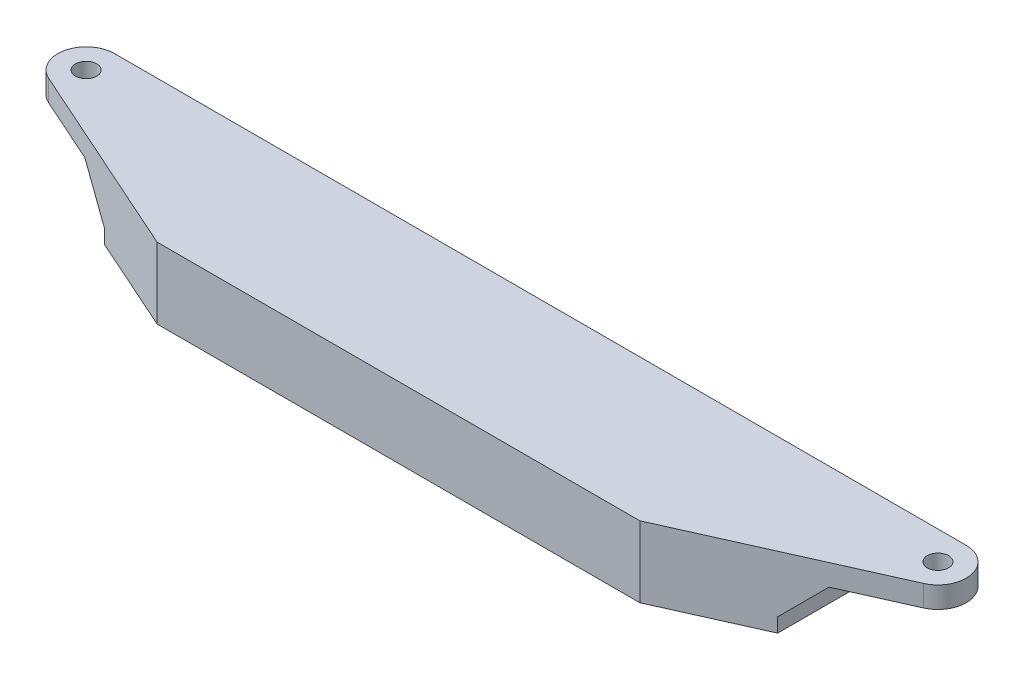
ISO-10303-21;
HEADER;
FILE_DESCRIPTION(('STEP AP214'),'2;1');
FILE_NAME('part.step','',(''),(''),'','','');
FILE_SCHEMA(('AUTOMOTIVE_DESIGN { 1 0 10303 214 1 1 1 1 }'));
ENDSEC;
DATA;
#1=APPLICATION_CONTEXT('core data for automotive mechanical design processes');
#2=APPLICATION_PROTOCOL_DEFINITION('international standard','automotive_design',2000,#1);
#3=PRODUCT_CONTEXT('',#1,'mechanical');
#4=PRODUCT('Part','Part','',(#3));
#5=PRODUCT_RELATED_PRODUCT_CATEGORY('part','',(#4));
#6=PRODUCT_DEFINITION_FORMATION('','',#4);
#7=PRODUCT_DEFINITION_CONTEXT('part definition',#1,'design');
#8=PRODUCT_DEFINITION('design','',#6,#7);
#9=PRODUCT_DEFINITION_SHAPE('','',#8);
#10=(LENGTH_UNIT() NAMED_UNIT(*) SI_UNIT(.MILLI.,.METRE.));
#11=(NAMED_UNIT(*) PLANE_ANGLE_UNIT() SI_UNIT($,.RADIAN.));
#12=(NAMED_UNIT(*) SI_UNIT($,.STERADIAN.) SOLID_ANGLE_UNIT());
#13=UNCERTAINTY_MEASURE_WITH_UNIT(LENGTH_MEASURE(1.E-05),#10,'distance_accuracy_value','');
#14=(GEOMETRIC_REPRESENTATION_CONTEXT(3) GLOBAL_UNCERTAINTY_ASSIGNED_CONTEXT((#13)) GLOBAL_UNIT_ASSIGNED_CONTEXT((#10,
#11,#12)) REPRESENTATION_CONTEXT('',''));
#15=CARTESIAN_POINT('',(0.,0.,0.));
#16=DIRECTION('',(0.,0.,1.));
#17=DIRECTION('',(1.,0.,0.));
#18=AXIS2_PLACEMENT_3D('',#15,#16,#17);
#19=CARTESIAN_POINT('',(60.,-8.,-4.00000000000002));
#20=DIRECTION('',(0.,1.,0.));
#21=DIRECTION('',(-1.,0.,0.));
#22=AXIS2_PLACEMENT_3D('',#19,#20,#21);
#23=PLANE('',#22);
#24=DIRECTION('',(0.912985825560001,0.,0.407991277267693));
#25=VECTOR('',#24,1.);
#26=CARTESIAN_POINT('',(-34.,-8.,16.));
#27=LINE('',#26,#25);
#28=CARTESIAN_POINT('',(-61.6319651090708,-8.,3.65194330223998));
#29=VERTEX_POINT('',#28);
#30=CARTESIAN_POINT('',(-34.,-8.,16.));
#31=VERTEX_POINT('',#30);
#32=EDGE_CURVE('E141',#29,#31,#27,.T.);
#33=ORIENTED_EDGE('',*,*,#32,.T.);
#34=DIRECTION('',(-1.,0.,0.));
#35=VECTOR('',#34,1.);
#36=CARTESIAN_POINT('',(-34.,-8.00000000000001,16.));
#37=LINE('',#36,#35);
#38=CARTESIAN_POINT('',(34.,-8.,16.));
#39=VERTEX_POINT('',#38);
#40=EDGE_CURVE('E138',#39,#31,#37,.T.);
#41=ORIENTED_EDGE('',*,*,#40,.F.);
#42=DIRECTION('',(-0.912985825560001,0.,0.407991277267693));
#43=VECTOR('',#42,1.);
#44=CARTESIAN_POINT('',(34.,-8.,16.));
#45=LINE('',#44,#43);
#46=CARTESIAN_POINT('',(61.6319651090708,-8.,3.65194330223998));
#47=VERTEX_POINT('',#46);
#48=EDGE_CURVE('E122',#47,#39,#45,.T.);
#49=ORIENTED_EDGE('',*,*,#48,.F.);
#50=CARTESIAN_POINT('',(60.,-8.,0.));
#51=DIRECTION('',(0.,1.,0.));
#52=DIRECTION('',(-1.,0.,0.));
#53=AXIS2_PLACEMENT_3D('',#50,#51,#52);
#54=CIRCLE('',#53,4.);
#55=CARTESIAN_POINT('',(60.,-8.,-4.00000000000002));
#56=VERTEX_POINT('',#55);
#57=EDGE_CURVE('E134',#56,#47,#54,.F.);
#58=ORIENTED_EDGE('',*,*,#57,.F.);
#59=DIRECTION('',(-1.,0.,0.));
#60=VECTOR('',#59,1.);
#61=CARTESIAN_POINT('',(-64.,-8.,-4.00000000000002));
#62=LINE('',#61,#60);
#63=CARTESIAN_POINT('',(-60.,-8.,-4.00000000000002));
#64=VERTEX_POINT('',#63);
#65=EDGE_CURVE('E175',#56,#64,#62,.T.);
#66=ORIENTED_EDGE('',*,*,#65,.T.);
#67=CARTESIAN_POINT('',(-60.,-8.,0.));
#68=DIRECTION('',(0.,-1.,0.));
#69=DIRECTION('',(1.,0.,0.));
#70=AXIS2_PLACEMENT_3D('',#67,#68,#69);
#71=CIRCLE('',#70,4.);
#72=EDGE_CURVE('E177',#64,#29,#71,.F.);
#73=ORIENTED_EDGE('',*,*,#72,.T.);
#74=EDGE_LOOP('',(#33,#41,#49,#58,#66,#73));
#75=FACE_BOUND('',#74,.T.);
#76=CARTESIAN_POINT('',(60.,-8.,0.));
#77=DIRECTION('',(0.,1.,0.));
#78=DIRECTION('',(-1.,0.,0.));
#79=AXIS2_PLACEMENT_3D('',#76,#77,#78);
#80=CIRCLE('',#79,1.5);
#81=CARTESIAN_POINT('',(58.5,-8.,0.));
#82=VERTEX_POINT('',#81);
#83=EDGE_CURVE('E180',#82,#82,#80,.T.);
#84=ORIENTED_EDGE('',*,*,#83,.F.);
#85=EDGE_LOOP('',(#84));
#86=FACE_BOUND('',#85,.T.);
#87=CARTESIAN_POINT('',(-60.,-8.,0.));
#88=DIRECTION('',(0.,-1.,0.));
#89=DIRECTION('',(1.,0.,0.));
#90=AXIS2_PLACEMENT_3D('',#87,#88,#89);
#91=CIRCLE('',#90,1.5);
#92=CARTESIAN_POINT('',(-58.5,-8.,0.));
#93=VERTEX_POINT('',#92);
#94=EDGE_CURVE('E39',#93,#93,#91,.F.);
#95=ORIENTED_EDGE('',*,*,#94,.F.);
#96=EDGE_LOOP('',(#95));
#97=FACE_BOUND('',#96,.T.);
#98=ADVANCED_FACE('F30',(#75,#86,#97),#23,.T.);
#99=CARTESIAN_POINT('',(-34.,11.,16.));
#100=DIRECTION('',(-0.407991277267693,0.,0.912985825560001));
#101=DIRECTION('',(0.912985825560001,0.,0.407991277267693));
#102=AXIS2_PLACEMENT_3D('',#99,#100,#101);
#103=PLANE('',#102);
#104=DIRECTION('',(0.,-1.,0.));
#105=VECTOR('',#104,1.);
#106=CARTESIAN_POINT('',(-34.,11.,16.));
#107=LINE('',#106,#105);
#108=CARTESIAN_POINT('',(-34.,-18.,16.));
#109=VERTEX_POINT('',#108);
#110=EDGE_CURVE('E150',#31,#109,#107,.T.);
#111=ORIENTED_EDGE('',*,*,#110,.F.);
#112=ORIENTED_EDGE('',*,*,#32,.F.);
#113=DIRECTION('',(0.,-1.,0.));
#114=VECTOR('',#113,1.);
#115=CARTESIAN_POINT('',(-61.6319651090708,11.,3.65194330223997));
#116=LINE('',#115,#114);
#117=CARTESIAN_POINT('',(-61.6319651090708,-11.,3.65194330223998));
#118=VERTEX_POINT('',#117);
#119=EDGE_CURVE('E153',#29,#118,#116,.T.);
#120=ORIENTED_EDGE('',*,*,#119,.T.);
#121=DIRECTION('',(0.912985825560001,0.,0.407991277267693));
#122=VECTOR('',#121,1.);
#123=CARTESIAN_POINT('',(-34.,-11.,16.));
#124=LINE('',#123,#122);
#125=CARTESIAN_POINT('',(-52.4265491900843,-11.,7.76562096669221));
#126=VERTEX_POINT('',#125);
#127=EDGE_CURVE('E214',#118,#126,#124,.T.);
#128=ORIENTED_EDGE('',*,*,#127,.T.);
#129=DIRECTION('',(-0.674246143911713,0.67424614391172,-0.301304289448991));
#130=VECTOR('',#129,1.);
#131=CARTESIAN_POINT('',(-54.816773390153,-8.6097757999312,6.6974875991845));
#132=LINE('',#131,#130);
#133=CARTESIAN_POINT('',(-47.4265491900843,-16.0000000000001,10.));
#134=VERTEX_POINT('',#133);
#135=EDGE_CURVE('E222',#126,#134,#132,.F.);
#136=ORIENTED_EDGE('',*,*,#135,.T.);
#137=DIRECTION('',(0.,-1.,0.));
#138=VECTOR('',#137,1.);
#139=CARTESIAN_POINT('',(-47.4265491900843,11.,10.));
#140=LINE('',#139,#138);
#141=CARTESIAN_POINT('',(-47.4265491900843,-18.,10.));
#142=VERTEX_POINT('',#141);
#143=EDGE_CURVE('E55',#134,#142,#140,.T.);
#144=ORIENTED_EDGE('',*,*,#143,.T.);
#145=DIRECTION('',(-0.912985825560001,0.,-0.407991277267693));
#146=VECTOR('',#145,1.);
#147=CARTESIAN_POINT('',(-34.,-18.,16.));
#148=LINE('',#147,#146);
#149=EDGE_CURVE('E151',#109,#142,#148,.T.);
#150=ORIENTED_EDGE('',*,*,#149,.F.);
#151=EDGE_LOOP('',(#111,#112,#120,#128,#136,#144,#150));
#152=FACE_BOUND('',#151,.T.);
#153=ADVANCED_FACE('F236',(#152),#103,.T.);
#154=CARTESIAN_POINT('',(-60.,11.,0.));
#155=DIRECTION('',(0.,-1.,0.));
#156=DIRECTION('',(0.,0.,-1.));
#157=AXIS2_PLACEMENT_3D('',#154,#155,#156);
#158=CYLINDRICAL_SURFACE('',#157,4.);
#159=DIRECTION('',(0.,-1.,0.));
#160=VECTOR('',#159,1.);
#161=CARTESIAN_POINT('',(-60.,11.,-4.00000000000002));
#162=LINE('',#161,#160);
#163=CARTESIAN_POINT('',(-60.,-11.,-4.00000000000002));
#164=VERTEX_POINT('',#163);
#165=EDGE_CURVE('E155',#64,#164,#162,.T.);
#166=ORIENTED_EDGE('',*,*,#165,.T.);
#167=CARTESIAN_POINT('',(-60.,-11.,0.));
#168=DIRECTION('',(0.,-1.,0.));
#169=DIRECTION('',(1.,0.,0.));
#170=AXIS2_PLACEMENT_3D('',#167,#168,#169);
#171=CIRCLE('',#170,4.);
#172=EDGE_CURVE('E47',#164,#118,#171,.F.);
#173=ORIENTED_EDGE('',*,*,#172,.T.);
#174=ORIENTED_EDGE('',*,*,#119,.F.);
#175=ORIENTED_EDGE('',*,*,#72,.F.);
#176=EDGE_LOOP('',(#166,#173,#174,#175));
#177=FACE_BOUND('',#176,.T.);
#178=ADVANCED_FACE('F245',(#177),#158,.T.);
#179=CARTESIAN_POINT('',(-64.,-11.,-4.00000000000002));
#180=DIRECTION('',(0.,-1.,0.));
#181=DIRECTION('',(1.,0.,0.));
#182=AXIS2_PLACEMENT_3D('',#179,#180,#181);
#183=PLANE('',#182);
#184=DIRECTION('',(1.,0.,0.));
#185=VECTOR('',#184,1.);
#186=CARTESIAN_POINT('',(-64.,-11.,-4.00000000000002));
#187=LINE('',#186,#185);
#188=CARTESIAN_POINT('',(-52.4265491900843,-11.,-4.00000000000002));
#189=VERTEX_POINT('',#188);
#190=EDGE_CURVE('E169',#164,#189,#187,.T.);
#191=ORIENTED_EDGE('',*,*,#190,.T.);
#192=DIRECTION('',(0.,0.,1.));
#193=VECTOR('',#192,1.);
#194=CARTESIAN_POINT('',(-52.4265491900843,-11.,10.));
#195=LINE('',#194,#193);
#196=EDGE_CURVE('E216',#189,#126,#195,.T.);
#197=ORIENTED_EDGE('',*,*,#196,.T.);
#198=ORIENTED_EDGE('',*,*,#127,.F.);
#199=ORIENTED_EDGE('',*,*,#172,.F.);
#200=EDGE_LOOP('',(#191,#197,#198,#199));
#201=FACE_BOUND('',#200,.T.);
#202=CARTESIAN_POINT('',(-60.,-11.,0.));
#203=DIRECTION('',(0.,-1.,0.));
#204=DIRECTION('',(1.,0.,0.));
#205=AXIS2_PLACEMENT_3D('',#202,#203,#204);
#206=CIRCLE('',#205,1.5);
#207=CARTESIAN_POINT('',(-58.5,-11.,0.));
#208=VERTEX_POINT('',#207);
#209=EDGE_CURVE('E11',#208,#208,#206,.F.);
#210=ORIENTED_EDGE('',*,*,#209,.T.);
#211=EDGE_LOOP('',(#210));
#212=FACE_BOUND('',#211,.T.);
#213=ADVANCED_FACE('F233',(#201,#212),#183,.T.);
#214=CARTESIAN_POINT('',(-60.,-18.,0.));
#215=DIRECTION('',(0.,1.,0.));
#216=DIRECTION('',(0.,0.,1.));
#217=AXIS2_PLACEMENT_3D('',#214,#215,#216);
#218=CYLINDRICAL_SURFACE('',#217,1.5);
#219=ORIENTED_EDGE('',*,*,#209,.F.);
#220=EDGE_LOOP('',(#219));
#221=FACE_BOUND('',#220,.T.);
#222=ORIENTED_EDGE('',*,*,#94,.T.);
#223=EDGE_LOOP('',(#222));
#224=FACE_BOUND('',#223,.T.);
#225=ADVANCED_FACE('F348',(#221,#224),#218,.F.);
#226=CARTESIAN_POINT('',(-52.4265491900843,-11.,-4.00000000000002));
#227=DIRECTION('',(-0.707106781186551,-0.707106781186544,0.));
#228=DIRECTION('',(0.707106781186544,-0.707106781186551,0.));
#229=AXIS2_PLACEMENT_3D('',#226,#227,#228);
#230=PLANE('',#229);
#231=DIRECTION('',(0.707106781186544,-0.707106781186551,0.));
#232=VECTOR('',#231,1.);
#233=CARTESIAN_POINT('',(-52.4265491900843,-11.,-4.00000000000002));
#234=LINE('',#233,#232);
#235=CARTESIAN_POINT('',(-47.4265491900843,-16.0000000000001,-4.00000000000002));
#236=VERTEX_POINT('',#235);
#237=EDGE_CURVE('E144',#236,#189,#234,.F.);
#238=ORIENTED_EDGE('',*,*,#237,.F.);
#239=DIRECTION('',(0.,0.,-1.));
#240=VECTOR('',#239,1.);
#241=CARTESIAN_POINT('',(-47.4265491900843,-16.0000000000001,-4.00000000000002));
#242=LINE('',#241,#240);
#243=EDGE_CURVE('E220',#134,#236,#242,.T.);
#244=ORIENTED_EDGE('',*,*,#243,.F.);
#245=ORIENTED_EDGE('',*,*,#135,.F.);
#246=ORIENTED_EDGE('',*,*,#196,.F.);
#247=EDGE_LOOP('',(#238,#244,#245,#246));
#248=FACE_BOUND('',#247,.T.);
#249=ADVANCED_FACE('F235',(#248),#230,.T.);
#250=CARTESIAN_POINT('',(-47.4265491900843,-18.,-4.00000000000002));
#251=DIRECTION('',(-1.,0.,0.));
#252=DIRECTION('',(0.,0.,1.));
#253=AXIS2_PLACEMENT_3D('',#250,#251,#252);
#254=PLANE('',#253);
#255=ORIENTED_EDGE('',*,*,#143,.F.);
#256=ORIENTED_EDGE('',*,*,#243,.T.);
#257=DIRECTION('',(0.,-1.,0.));
#258=VECTOR('',#257,1.);
#259=CARTESIAN_POINT('',(-47.4265491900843,-18.,-4.00000000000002));
#260=LINE('',#259,#258);
#261=CARTESIAN_POINT('',(-47.4265491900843,-18.,-4.00000000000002));
#262=VERTEX_POINT('',#261);
#263=EDGE_CURVE('E167',#236,#262,#260,.T.);
#264=ORIENTED_EDGE('',*,*,#263,.T.);
#265=DIRECTION('',(0.,0.,1.));
#266=VECTOR('',#265,1.);
#267=CARTESIAN_POINT('',(-47.4265491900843,-18.,-4.00000000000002));
#268=LINE('',#267,#266);
#269=EDGE_CURVE('E171',#262,#142,#268,.T.);
#270=ORIENTED_EDGE('',*,*,#269,.T.);
#271=EDGE_LOOP('',(#255,#256,#264,#270));
#272=FACE_BOUND('',#271,.T.);
#273=ADVANCED_FACE('F238',(#272),#254,.T.);
#274=CARTESIAN_POINT('',(60.,11.,0.));
#275=DIRECTION('',(0.,-1.,0.));
#276=DIRECTION('',(0.,0.,-1.));
#277=AXIS2_PLACEMENT_3D('',#274,#275,#276);
#278=CYLINDRICAL_SURFACE('',#277,4.);
#279=CARTESIAN_POINT('',(60.,-11.,0.));
#280=DIRECTION('',(0.,1.,0.));
#281=DIRECTION('',(-1.,0.,0.));
#282=AXIS2_PLACEMENT_3D('',#279,#280,#281);
#283=CIRCLE('',#282,4.);
#284=CARTESIAN_POINT('',(60.,-11.,-4.00000000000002));
#285=VERTEX_POINT('',#284);
#286=CARTESIAN_POINT('',(61.6319651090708,-11.,3.65194330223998));
#287=VERTEX_POINT('',#286);
#288=EDGE_CURVE('E188',#285,#287,#283,.F.);
#289=ORIENTED_EDGE('',*,*,#288,.F.);
#290=DIRECTION('',(0.,-1.,0.));
#291=VECTOR('',#290,1.);
#292=CARTESIAN_POINT('',(60.,11.,-4.00000000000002));
#293=LINE('',#292,#291);
#294=EDGE_CURVE('E160',#56,#285,#293,.T.);
#295=ORIENTED_EDGE('',*,*,#294,.F.);
#296=ORIENTED_EDGE('',*,*,#57,.T.);
#297=DIRECTION('',(0.,-1.,0.));
#298=VECTOR('',#297,1.);
#299=CARTESIAN_POINT('',(61.6319651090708,11.,3.65194330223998));
#300=LINE('',#299,#298);
#301=EDGE_CURVE('E130',#47,#287,#300,.T.);
#302=ORIENTED_EDGE('',*,*,#301,.T.);
#303=EDGE_LOOP('',(#289,#295,#296,#302));
#304=FACE_BOUND('',#303,.T.);
#305=ADVANCED_FACE('F250',(#304),#278,.T.);
#306=CARTESIAN_POINT('',(64.,-11.,-8.));
#307=DIRECTION('',(0.,1.,0.));
#308=DIRECTION('',(-1.,0.,0.));
#309=AXIS2_PLACEMENT_3D('',#306,#307,#308);
#310=PLANE('',#309);
#311=CARTESIAN_POINT('',(60.,-11.,0.));
#312=DIRECTION('',(0.,1.,0.));
#313=DIRECTION('',(-1.,0.,0.));
#314=AXIS2_PLACEMENT_3D('',#311,#312,#313);
#315=CIRCLE('',#314,1.5);
#316=CARTESIAN_POINT('',(58.5,-11.,0.));
#317=VERTEX_POINT('',#316);
#318=EDGE_CURVE('E179',#317,#317,#315,.T.);
#319=ORIENTED_EDGE('',*,*,#318,.T.);
#320=EDGE_LOOP('',(#319));
#321=FACE_BOUND('',#320,.T.);
#322=DIRECTION('',(-0.912985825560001,0.,0.407991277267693));
#323=VECTOR('',#322,1.);
#324=CARTESIAN_POINT('',(34.,-11.,16.));
#325=LINE('',#324,#323);
#326=CARTESIAN_POINT('',(52.4265491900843,-11.,7.76562096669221));
#327=VERTEX_POINT('',#326);
#328=EDGE_CURVE('E190',#287,#327,#325,.T.);
#329=ORIENTED_EDGE('',*,*,#328,.T.);
#330=DIRECTION('',(0.,0.,-1.));
#331=VECTOR('',#330,1.);
#332=CARTESIAN_POINT('',(52.4265491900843,-11.,-4.00000000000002));
#333=LINE('',#332,#331);
#334=CARTESIAN_POINT('',(52.4265491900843,-11.,-4.00000000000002));
#335=VERTEX_POINT('',#334);
#336=EDGE_CURVE('E207',#327,#335,#333,.T.);
#337=ORIENTED_EDGE('',*,*,#336,.T.);
#338=DIRECTION('',(1.,0.,0.));
#339=VECTOR('',#338,1.);
#340=CARTESIAN_POINT('',(-60.,-11.,-4.00000000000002));
#341=LINE('',#340,#339);
#342=EDGE_CURVE('E200',#335,#285,#341,.T.);
#343=ORIENTED_EDGE('',*,*,#342,.T.);
#344=ORIENTED_EDGE('',*,*,#288,.T.);
#345=EDGE_LOOP('',(#329,#337,#343,#344));
#346=FACE_BOUND('',#345,.T.);
#347=ADVANCED_FACE('F252',(#321,#346),#310,.F.);
#348=CARTESIAN_POINT('',(60.,-18.,0.));
#349=DIRECTION('',(0.,1.,0.));
#350=DIRECTION('',(0.,0.,1.));
#351=AXIS2_PLACEMENT_3D('',#348,#349,#350);
#352=CYLINDRICAL_SURFACE('',#351,1.5);
#353=ORIENTED_EDGE('',*,*,#83,.T.);
#354=EDGE_LOOP('',(#353));
#355=FACE_BOUND('',#354,.T.);
#356=ORIENTED_EDGE('',*,*,#318,.F.);
#357=EDGE_LOOP('',(#356));
#358=FACE_BOUND('',#357,.T.);
#359=ADVANCED_FACE('F270',(#355,#358),#352,.F.);
#360=CARTESIAN_POINT('',(47.4265491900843,-16.0000000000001,-8.));
#361=DIRECTION('',(0.707106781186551,-0.707106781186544,0.));
#362=DIRECTION('',(0.707106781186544,0.707106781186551,0.));
#363=AXIS2_PLACEMENT_3D('',#360,#361,#362);
#364=PLANE('',#363);
#365=DIRECTION('',(0.707106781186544,0.707106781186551,0.));
#366=VECTOR('',#365,1.);
#367=CARTESIAN_POINT('',(47.4265491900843,-16.0000000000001,-4.00000000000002));
#368=LINE('',#367,#366);
#369=CARTESIAN_POINT('',(47.4265491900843,-16.0000000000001,-4.00000000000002));
#370=VERTEX_POINT('',#369);
#371=EDGE_CURVE('E211',#335,#370,#368,.F.);
#372=ORIENTED_EDGE('',*,*,#371,.F.);
#373=ORIENTED_EDGE('',*,*,#336,.F.);
#374=DIRECTION('',(-0.674246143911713,-0.67424614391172,0.301304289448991));
#375=VECTOR('',#374,1.);
#376=CARTESIAN_POINT('',(51.083307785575,-12.3432414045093,8.36588305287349));
#377=LINE('',#376,#375);
#378=CARTESIAN_POINT('',(47.4265491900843,-16.0000000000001,10.));
#379=VERTEX_POINT('',#378);
#380=EDGE_CURVE('E209',#379,#327,#377,.F.);
#381=ORIENTED_EDGE('',*,*,#380,.F.);
#382=DIRECTION('',(0.,0.,1.));
#383=VECTOR('',#382,1.);
#384=CARTESIAN_POINT('',(47.4265491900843,-16.0000000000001,10.));
#385=LINE('',#384,#383);
#386=EDGE_CURVE('E202',#370,#379,#385,.T.);
#387=ORIENTED_EDGE('',*,*,#386,.F.);
#388=EDGE_LOOP('',(#372,#373,#381,#387));
#389=FACE_BOUND('',#388,.T.);
#390=ADVANCED_FACE('F258',(#389),#364,.T.);
#391=CARTESIAN_POINT('',(47.4265491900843,-18.,-8.));
#392=DIRECTION('',(-1.,0.,0.));
#393=DIRECTION('',(0.,0.,1.));
#394=AXIS2_PLACEMENT_3D('',#391,#392,#393);
#395=PLANE('',#394);
#396=DIRECTION('',(0.,1.,0.));
#397=VECTOR('',#396,1.);
#398=CARTESIAN_POINT('',(47.4265491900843,11.,-4.00000000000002));
#399=LINE('',#398,#397);
#400=CARTESIAN_POINT('',(47.4265491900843,-18.,-4.00000000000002));
#401=VERTEX_POINT('',#400);
#402=EDGE_CURVE('E183',#401,#370,#399,.T.);
#403=ORIENTED_EDGE('',*,*,#402,.T.);
#404=ORIENTED_EDGE('',*,*,#386,.T.);
#405=DIRECTION('',(0.,-1.,0.));
#406=VECTOR('',#405,1.);
#407=CARTESIAN_POINT('',(47.4265491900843,11.,10.));
#408=LINE('',#407,#406);
#409=CARTESIAN_POINT('',(47.4265491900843,-18.,10.));
#410=VERTEX_POINT('',#409);
#411=EDGE_CURVE('E186',#379,#410,#408,.T.);
#412=ORIENTED_EDGE('',*,*,#411,.T.);
#413=DIRECTION('',(0.,0.,1.));
#414=VECTOR('',#413,1.);
#415=CARTESIAN_POINT('',(47.4265491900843,-18.,0.));
#416=LINE('',#415,#414);
#417=EDGE_CURVE('E163',#401,#410,#416,.T.);
#418=ORIENTED_EDGE('',*,*,#417,.F.);
#419=EDGE_LOOP('',(#403,#404,#412,#418));
#420=FACE_BOUND('',#419,.T.);
#421=ADVANCED_FACE('F260',(#420),#395,.F.);
#422=CARTESIAN_POINT('',(60.,-18.,0.));
#423=DIRECTION('',(0.,1.,0.));
#424=DIRECTION('',(0.,0.,1.));
#425=AXIS2_PLACEMENT_3D('',#422,#423,#424);
#426=PLANE('',#425);
#427=ORIENTED_EDGE('',*,*,#269,.F.);
#428=DIRECTION('',(1.,0.,0.));
#429=VECTOR('',#428,1.);
#430=CARTESIAN_POINT('',(-60.,-18.,-4.00000000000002));
#431=LINE('',#430,#429);
#432=EDGE_CURVE('E149',#262,#401,#431,.T.);
#433=ORIENTED_EDGE('',*,*,#432,.T.);
#434=ORIENTED_EDGE('',*,*,#417,.T.);
#435=DIRECTION('',(-0.912985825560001,0.,0.407991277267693));
#436=VECTOR('',#435,1.);
#437=CARTESIAN_POINT('',(34.,-18.,16.));
#438=LINE('',#437,#436);
#439=CARTESIAN_POINT('',(34.,-18.,16.));
#440=VERTEX_POINT('',#439);
#441=EDGE_CURVE('E135',#410,#440,#438,.T.);
#442=ORIENTED_EDGE('',*,*,#441,.T.);
#443=DIRECTION('',(-1.,0.,0.));
#444=VECTOR('',#443,1.);
#445=CARTESIAN_POINT('',(-34.,-18.,16.));
#446=LINE('',#445,#444);
#447=EDGE_CURVE('E148',#440,#109,#446,.T.);
#448=ORIENTED_EDGE('',*,*,#447,.T.);
#449=ORIENTED_EDGE('',*,*,#149,.T.);
#450=EDGE_LOOP('',(#427,#433,#434,#442,#448,#449));
#451=FACE_BOUND('',#450,.T.);
#452=ADVANCED_FACE('F241',(#451),#426,.F.);
#453=CARTESIAN_POINT('',(-34.,11.,16.));
#454=DIRECTION('',(0.,0.,1.));
#455=DIRECTION('',(1.,0.,0.));
#456=AXIS2_PLACEMENT_3D('',#453,#454,#455);
#457=PLANE('',#456);
#458=DIRECTION('',(0.,-1.,0.));
#459=VECTOR('',#458,1.);
#460=CARTESIAN_POINT('',(34.,11.,16.));
#461=LINE('',#460,#459);
#462=EDGE_CURVE('E34',#39,#440,#461,.T.);
#463=ORIENTED_EDGE('',*,*,#462,.F.);
#464=ORIENTED_EDGE('',*,*,#40,.T.);
#465=ORIENTED_EDGE('',*,*,#110,.T.);
#466=ORIENTED_EDGE('',*,*,#447,.F.);
#467=EDGE_LOOP('',(#463,#464,#465,#466));
#468=FACE_BOUND('',#467,.T.);
#469=ADVANCED_FACE('F32',(#468),#457,.T.);
#470=CARTESIAN_POINT('',(34.,11.,16.));
#471=DIRECTION('',(0.407991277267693,0.,0.912985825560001));
#472=DIRECTION('',(0.912985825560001,0.,-0.407991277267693));
#473=AXIS2_PLACEMENT_3D('',#470,#471,#472);
#474=PLANE('',#473);
#475=ORIENTED_EDGE('',*,*,#48,.T.);
#476=ORIENTED_EDGE('',*,*,#462,.T.);
#477=ORIENTED_EDGE('',*,*,#441,.F.);
#478=ORIENTED_EDGE('',*,*,#411,.F.);
#479=ORIENTED_EDGE('',*,*,#380,.T.);
#480=ORIENTED_EDGE('',*,*,#328,.F.);
#481=ORIENTED_EDGE('',*,*,#301,.F.);
#482=EDGE_LOOP('',(#475,#476,#477,#478,#479,#480,#481));
#483=FACE_BOUND('',#482,.T.);
#484=ADVANCED_FACE('F124',(#483),#474,.T.);
#485=CARTESIAN_POINT('',(-60.,11.,-4.00000000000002));
#486=DIRECTION('',(0.,0.,-1.));
#487=DIRECTION('',(-1.,0.,0.));
#488=AXIS2_PLACEMENT_3D('',#485,#486,#487);
#489=PLANE('',#488);
#490=ORIENTED_EDGE('',*,*,#65,.F.);
#491=ORIENTED_EDGE('',*,*,#294,.T.);
#492=ORIENTED_EDGE('',*,*,#342,.F.);
#493=ORIENTED_EDGE('',*,*,#371,.T.);
#494=ORIENTED_EDGE('',*,*,#402,.F.);
#495=ORIENTED_EDGE('',*,*,#432,.F.);
#496=ORIENTED_EDGE('',*,*,#263,.F.);
#497=ORIENTED_EDGE('',*,*,#237,.T.);
#498=ORIENTED_EDGE('',*,*,#190,.F.);
#499=ORIENTED_EDGE('',*,*,#165,.F.);
#500=EDGE_LOOP('',(#490,#491,#492,#493,#494,#495,#496,#497,#498,#499));
#501=FACE_BOUND('',#500,.T.);
#502=ADVANCED_FACE('F227',(#501),#489,.T.);
#503=CLOSED_SHELL('',(#98,#153,#178,#213,#225,#249,#273,#305,#347,#359,#390,#421,#452,#469,#484,#502));
#504=MANIFOLD_SOLID_BREP('B2',#503);
#505=ADVANCED_BREP_SHAPE_REPRESENTATION('',(#18,#504),#14);
#506=SHAPE_DEFINITION_REPRESENTATION(#9,#505);
ENDSEC;
END-ISO-10303-21;
